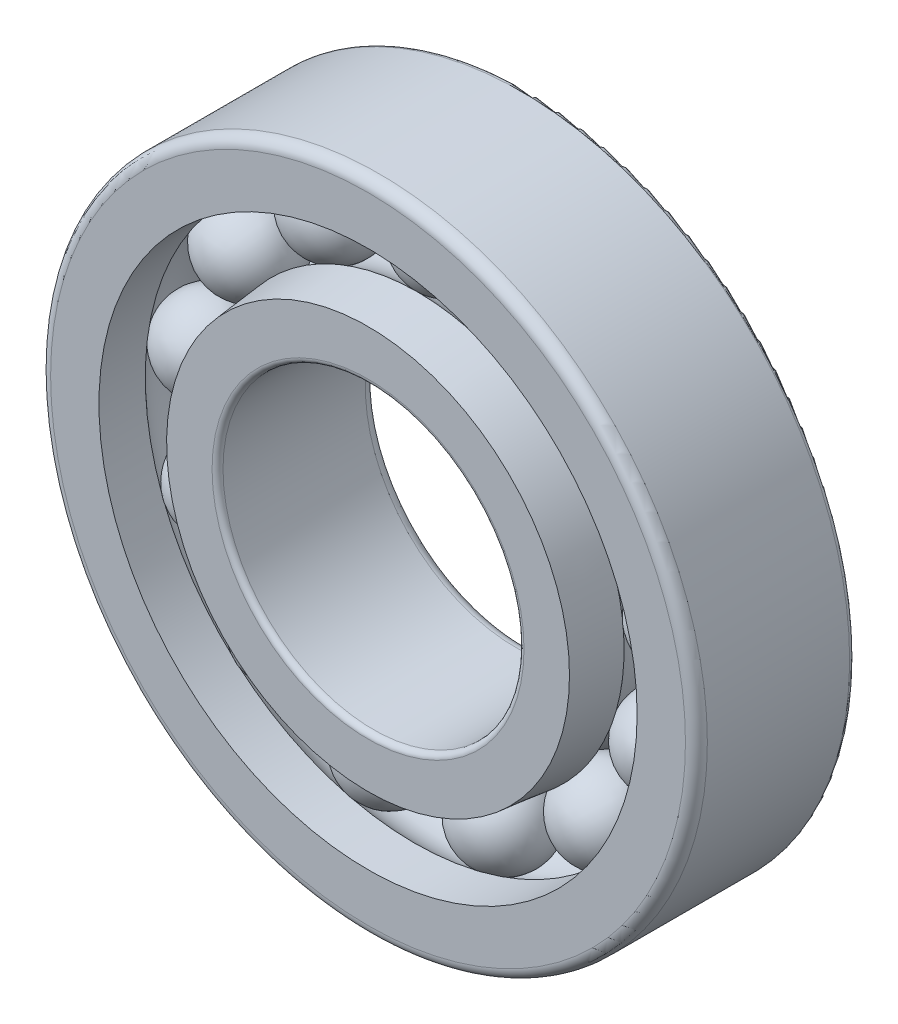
from build123d import *

# Parameters (mm, degrees)
FILLET1_R            = 2
FILLET2_R            = 1
CIRPATTERNBALL_COUNT = 13


with BuildPart() as part:
    # BaseSke → Ball (revolve)
    with BuildSketch(Plane(origin=(0, 0, 0), x_dir=(0, 0, -1), z_dir=(1, 0, 0))):
        with BuildLine():
            Line((0, 51.875), (0, 35.625))
            ThreePointArc((0, 35.625), (-8.125, 43.75), (0, 51.875))
        make_face()
    ball = revolve(axis=Axis((0, 51.875, 0), (0, -1, 0)))

    # OuterRaceSke → OuterRace (revolve)
    with BuildSketch(Plane(origin=(0, 0, 0), x_dir=(0, 0, -1), z_dir=(1, 0, 0)), mode=Mode.PRIVATE) as outerrace_sk:
        with BuildLine():
            Line((-14.5, 60), (14.5, 60))
            Line((14.5, 60), (14.5, 50.690678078))
            Line((14.5, 50.690678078), (5.472721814, 49.741872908))
            ThreePointArc((5.472721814, 49.741872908), (-0.404850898, 51.854894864), (-6.042594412, 49.166666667))
            Line((-6.042594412, 49.166666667), (-14.5, 49.166666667))
            Line((-14.5, 49.166666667), (-14.5, 60))
        make_face()
    revolve(outerrace_sk.sketch.rotate(Axis((0, 0, 50.391616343), (0, 0, -1)), 90), axis=Axis((0, 0, 50.391616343), (0, 0, -1)))

    # InnerRaceSke → InnerRace (revolve)
    with BuildSketch(Plane(origin=(0, 0, 0), x_dir=(0, 0, -1), z_dir=(1, 0, 0)), mode=Mode.PRIVATE) as innerrace_sk:
        with BuildLine():
            Line((-14.5, 27.5), (14.5, 27.5))
            Line((14.5, 27.5), (14.5, 38.333333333))
            Line((14.5, 38.333333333), (6.042594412, 38.333333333))
            ThreePointArc((6.042594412, 38.333333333), (0, 35.635), (-6.042594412, 38.333333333))
            Line((-6.042594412, 38.333333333), (-14.5, 38.333333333))
            Line((-14.5, 38.333333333), (-14.5, 27.5))
        make_face()
    revolve(innerrace_sk.sketch.rotate(Axis((0, 0, 70.862590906), (0, 0, -1)), 90), axis=Axis((0, 0, 70.862590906), (0, 0, -1)))

    # Fillet1
    fillet1_edges = [part.edges().sort_by_distance(p)[0] for p in [
        (-27.5, 0, -14.5),
        (-60, 0, 14.5),
    ]]
    fillet(fillet1_edges, radius=FILLET1_R)

    # Fillet2
    fillet2_edges = [part.edges().sort_by_distance(p)[0] for p in [
        (-27.5, 0, 14.5),
        (-60, 0, -14.5),
    ]]
    fillet(fillet2_edges, radius=FILLET2_R)

    # CutInnerRaceSke → CutInnerRace (revolve, cut)
    with BuildSketch(Plane(origin=(0, 0, 0), x_dir=(0, 0, -1), z_dir=(1, 0, 0)), mode=Mode.PRIVATE) as cutinnerrace_sk:
        with BuildLine():
            Line((-6.042594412, 38.333333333), (-14.5, 38.333333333))
            Line((-14.5, 38.333333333), (-14.5, 36.809321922))
            Line((-14.5, 36.809321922), (-5.472721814, 37.758127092))
            ThreePointArc((-5.472721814, 37.758127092), (-5.764836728, 38.038618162), (-6.042594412, 38.333333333))
        make_face()
    revolve(cutinnerrace_sk.sketch.rotate(Axis((0, 0, 28.306583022), (0, 0, -1)), 270), axis=Axis((0, 0, 28.306583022), (0, 0, -1)), mode=Mode.SUBTRACT)

    # CirPatternBall: Ball ×13 about axis
    cirpatternball_axis = Axis((0, 0, 0), (0, 0, 1))
    for i in range(1, CIRPATTERNBALL_COUNT):
        add(ball.rotate(cirpatternball_axis, i * 360 / CIRPATTERNBALL_COUNT))


solid = part.part
